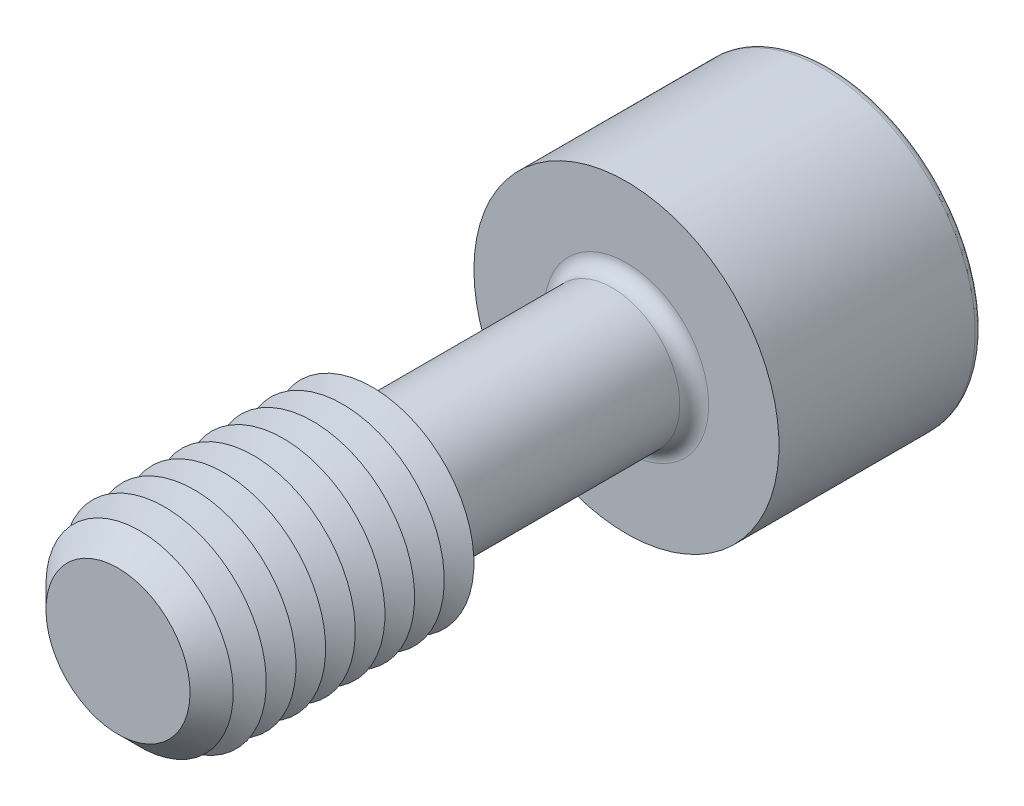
ISO-10303-21;
HEADER;
FILE_DESCRIPTION(('STEP AP214'),'2;1');
FILE_NAME('part.step','',(''),(''),'','','');
FILE_SCHEMA(('AUTOMOTIVE_DESIGN { 1 0 10303 214 1 1 1 1 }'));
ENDSEC;
DATA;
#1=APPLICATION_CONTEXT('core data for automotive mechanical design processes');
#2=APPLICATION_PROTOCOL_DEFINITION('international standard','automotive_design',2000,#1);
#3=PRODUCT_CONTEXT('',#1,'mechanical');
#4=PRODUCT('Part','Part','',(#3));
#5=PRODUCT_RELATED_PRODUCT_CATEGORY('part','',(#4));
#6=PRODUCT_DEFINITION_FORMATION('','',#4);
#7=PRODUCT_DEFINITION_CONTEXT('part definition',#1,'design');
#8=PRODUCT_DEFINITION('design','',#6,#7);
#9=PRODUCT_DEFINITION_SHAPE('','',#8);
#10=(LENGTH_UNIT() NAMED_UNIT(*) SI_UNIT(.MILLI.,.METRE.));
#11=(NAMED_UNIT(*) PLANE_ANGLE_UNIT() SI_UNIT($,.RADIAN.));
#12=(NAMED_UNIT(*) SI_UNIT($,.STERADIAN.) SOLID_ANGLE_UNIT());
#13=UNCERTAINTY_MEASURE_WITH_UNIT(LENGTH_MEASURE(1.E-05),#10,'distance_accuracy_value','');
#14=(GEOMETRIC_REPRESENTATION_CONTEXT(3) GLOBAL_UNCERTAINTY_ASSIGNED_CONTEXT((#13)) GLOBAL_UNIT_ASSIGNED_CONTEXT((#10,
#11,#12)) REPRESENTATION_CONTEXT('',''));
#15=CARTESIAN_POINT('',(0.,0.,0.));
#16=DIRECTION('',(0.,0.,1.));
#17=DIRECTION('',(1.,0.,0.));
#18=AXIS2_PLACEMENT_3D('',#15,#16,#17);
#19=CARTESIAN_POINT('',(-2.88675134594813,-5.,-17.));
#20=DIRECTION('',(0.,0.,1.));
#21=DIRECTION('',(1.,0.,0.));
#22=AXIS2_PLACEMENT_3D('',#19,#20,#21);
#23=PLANE('',#22);
#24=DIRECTION('',(1.,0.,0.));
#25=VECTOR('',#24,1.);
#26=CARTESIAN_POINT('',(-2.88675134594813,-5.,-17.));
#27=LINE('',#26,#25);
#28=CARTESIAN_POINT('',(0.,-5.,-17.));
#29=VERTEX_POINT('',#28);
#30=CARTESIAN_POINT('',(2.88675134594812,-5.,-17.));
#31=VERTEX_POINT('',#30);
#32=EDGE_CURVE('E762',#29,#31,#27,.T.);
#33=ORIENTED_EDGE('',*,*,#32,.F.);
#34=CARTESIAN_POINT('',(0.,0.,-17.));
#35=DIRECTION('',(0.,0.,1.));
#36=DIRECTION('',(0.,-1.,0.));
#37=AXIS2_PLACEMENT_3D('',#34,#35,#36);
#38=CIRCLE('',#37,5.);
#39=CARTESIAN_POINT('',(4.3301270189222,-2.5,-17.));
#40=VERTEX_POINT('',#39);
#41=EDGE_CURVE('E53',#29,#40,#38,.T.);
#42=ORIENTED_EDGE('',*,*,#41,.T.);
#43=DIRECTION('',(0.5,0.866025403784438,0.));
#44=VECTOR('',#43,1.);
#45=CARTESIAN_POINT('',(2.88675134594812,-5.,-17.));
#46=LINE('',#45,#44);
#47=EDGE_CURVE('E748',#31,#40,#46,.T.);
#48=ORIENTED_EDGE('',*,*,#47,.F.);
#49=EDGE_LOOP('',(#33,#42,#48));
#50=FACE_BOUND('',#49,.T.);
#51=ADVANCED_FACE('F41',(#50),#23,.F.);
#52=CARTESIAN_POINT('',(5.77350269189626,0.,-17.));
#53=VERTEX_POINT('',#52);
#54=EDGE_CURVE('E759',#40,#53,#46,.T.);
#55=ORIENTED_EDGE('',*,*,#54,.F.);
#56=CARTESIAN_POINT('',(4.3301270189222,2.50000000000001,-17.));
#57=VERTEX_POINT('',#56);
#58=EDGE_CURVE('E11',#40,#57,#38,.T.);
#59=ORIENTED_EDGE('',*,*,#58,.T.);
#60=DIRECTION('',(-0.5,0.866025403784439,0.));
#61=VECTOR('',#60,1.);
#62=CARTESIAN_POINT('',(5.77350269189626,0.,-17.));
#63=LINE('',#62,#61);
#64=EDGE_CURVE('E747',#53,#57,#63,.T.);
#65=ORIENTED_EDGE('',*,*,#64,.F.);
#66=EDGE_LOOP('',(#55,#59,#65));
#67=FACE_BOUND('',#66,.T.);
#68=ADVANCED_FACE('F133',(#67),#23,.F.);
#69=CARTESIAN_POINT('',(2.88675134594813,5.,-17.));
#70=VERTEX_POINT('',#69);
#71=EDGE_CURVE('E743',#57,#70,#63,.T.);
#72=ORIENTED_EDGE('',*,*,#71,.F.);
#73=CARTESIAN_POINT('',(0.,5.00000000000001,-17.));
#74=VERTEX_POINT('',#73);
#75=EDGE_CURVE('E51',#57,#74,#38,.T.);
#76=ORIENTED_EDGE('',*,*,#75,.T.);
#77=DIRECTION('',(-1.,0.,0.));
#78=VECTOR('',#77,1.);
#79=CARTESIAN_POINT('',(2.88675134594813,5.,-17.));
#80=LINE('',#79,#78);
#81=EDGE_CURVE('E177',#70,#74,#80,.T.);
#82=ORIENTED_EDGE('',*,*,#81,.F.);
#83=EDGE_LOOP('',(#72,#76,#82));
#84=FACE_BOUND('',#83,.T.);
#85=ADVANCED_FACE('F139',(#84),#23,.F.);
#86=CARTESIAN_POINT('',(-2.88675134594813,5.,-17.));
#87=VERTEX_POINT('',#86);
#88=EDGE_CURVE('E753',#74,#87,#80,.T.);
#89=ORIENTED_EDGE('',*,*,#88,.F.);
#90=CARTESIAN_POINT('',(-4.3301270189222,2.50000000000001,-17.));
#91=VERTEX_POINT('',#90);
#92=EDGE_CURVE('E264',#74,#91,#38,.T.);
#93=ORIENTED_EDGE('',*,*,#92,.T.);
#94=DIRECTION('',(-0.5,-0.866025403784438,0.));
#95=VECTOR('',#94,1.);
#96=CARTESIAN_POINT('',(-2.88675134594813,5.,-17.));
#97=LINE('',#96,#95);
#98=EDGE_CURVE('E176',#87,#91,#97,.T.);
#99=ORIENTED_EDGE('',*,*,#98,.F.);
#100=EDGE_LOOP('',(#89,#93,#99));
#101=FACE_BOUND('',#100,.T.);
#102=ADVANCED_FACE('F157',(#101),#23,.F.);
#103=CARTESIAN_POINT('',(-5.77350269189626,0.,-17.));
#104=VERTEX_POINT('',#103);
#105=EDGE_CURVE('E170',#91,#104,#97,.T.);
#106=ORIENTED_EDGE('',*,*,#105,.F.);
#107=CARTESIAN_POINT('',(-4.3301270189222,-2.5,-17.));
#108=VERTEX_POINT('',#107);
#109=EDGE_CURVE('E172',#91,#108,#38,.T.);
#110=ORIENTED_EDGE('',*,*,#109,.T.);
#111=DIRECTION('',(0.5,-0.866025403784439,0.));
#112=VECTOR('',#111,1.);
#113=CARTESIAN_POINT('',(-5.77350269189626,0.,-17.));
#114=LINE('',#113,#112);
#115=EDGE_CURVE('E174',#104,#108,#114,.T.);
#116=ORIENTED_EDGE('',*,*,#115,.F.);
#117=EDGE_LOOP('',(#106,#110,#116));
#118=FACE_BOUND('',#117,.T.);
#119=ADVANCED_FACE('F146',(#118),#23,.F.);
#120=CARTESIAN_POINT('',(0.,0.,-27.));
#121=DIRECTION('',(0.,0.,-1.));
#122=DIRECTION('',(-1.,0.,0.));
#123=AXIS2_PLACEMENT_3D('',#120,#121,#122);
#124=PLANE('',#123);
#125=CARTESIAN_POINT('',(0.,0.,-27.));
#126=DIRECTION('',(0.,0.,-1.));
#127=DIRECTION('',(-1.,0.,0.));
#128=AXIS2_PLACEMENT_3D('',#125,#126,#127);
#129=CIRCLE('',#128,8.575);
#130=CARTESIAN_POINT('',(-8.575,0.,-27.));
#131=VERTEX_POINT('',#130);
#132=EDGE_CURVE('E250',#131,#131,#129,.T.);
#133=ORIENTED_EDGE('',*,*,#132,.T.);
#134=EDGE_LOOP('',(#133));
#135=FACE_BOUND('',#134,.T.);
#136=DIRECTION('',(-0.5,-0.866025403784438,0.));
#137=VECTOR('',#136,1.);
#138=CARTESIAN_POINT('',(-2.88675134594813,5.,-27.));
#139=LINE('',#138,#137);
#140=CARTESIAN_POINT('',(-2.88675134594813,5.,-27.));
#141=VERTEX_POINT('',#140);
#142=CARTESIAN_POINT('',(-5.77350269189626,0.,-27.));
#143=VERTEX_POINT('',#142);
#144=EDGE_CURVE('E211',#141,#143,#139,.T.);
#145=ORIENTED_EDGE('',*,*,#144,.T.);
#146=DIRECTION('',(0.5,-0.866025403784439,0.));
#147=VECTOR('',#146,1.);
#148=CARTESIAN_POINT('',(-5.77350269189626,0.,-27.));
#149=LINE('',#148,#147);
#150=CARTESIAN_POINT('',(-2.88675134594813,-5.,-27.));
#151=VERTEX_POINT('',#150);
#152=EDGE_CURVE('E67',#143,#151,#149,.T.);
#153=ORIENTED_EDGE('',*,*,#152,.T.);
#154=DIRECTION('',(1.,0.,0.));
#155=VECTOR('',#154,1.);
#156=CARTESIAN_POINT('',(-2.88675134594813,-5.,-27.));
#157=LINE('',#156,#155);
#158=CARTESIAN_POINT('',(2.88675134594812,-5.,-27.));
#159=VERTEX_POINT('',#158);
#160=EDGE_CURVE('E196',#151,#159,#157,.T.);
#161=ORIENTED_EDGE('',*,*,#160,.T.);
#162=DIRECTION('',(0.5,0.866025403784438,0.));
#163=VECTOR('',#162,1.);
#164=CARTESIAN_POINT('',(2.88675134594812,-5.,-27.));
#165=LINE('',#164,#163);
#166=CARTESIAN_POINT('',(5.77350269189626,0.,-27.));
#167=VERTEX_POINT('',#166);
#168=EDGE_CURVE('E199',#159,#167,#165,.T.);
#169=ORIENTED_EDGE('',*,*,#168,.T.);
#170=DIRECTION('',(-0.5,0.866025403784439,0.));
#171=VECTOR('',#170,1.);
#172=CARTESIAN_POINT('',(5.77350269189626,0.,-27.));
#173=LINE('',#172,#171);
#174=CARTESIAN_POINT('',(2.88675134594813,5.,-27.));
#175=VERTEX_POINT('',#174);
#176=EDGE_CURVE('E203',#167,#175,#173,.T.);
#177=ORIENTED_EDGE('',*,*,#176,.T.);
#178=DIRECTION('',(-1.,0.,0.));
#179=VECTOR('',#178,1.);
#180=CARTESIAN_POINT('',(2.88675134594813,5.,-27.));
#181=LINE('',#180,#179);
#182=EDGE_CURVE('E207',#175,#141,#181,.T.);
#183=ORIENTED_EDGE('',*,*,#182,.T.);
#184=EDGE_LOOP('',(#145,#153,#161,#169,#177,#183));
#185=FACE_BOUND('',#184,.T.);
#186=ADVANCED_FACE('F156',(#135,#185),#124,.T.);
#187=CARTESIAN_POINT('',(0.,0.,15.));
#188=DIRECTION('',(0.,0.,-1.));
#189=DIRECTION('',(-1.,0.,0.));
#190=AXIS2_PLACEMENT_3D('',#187,#188,#189);
#191=CYLINDRICAL_SURFACE('',#190,4.);
#192=CARTESIAN_POINT('',(0.,0.,-14.15));
#193=DIRECTION('',(0.,0.,-1.));
#194=DIRECTION('',(-1.,0.,0.));
#195=AXIS2_PLACEMENT_3D('',#192,#193,#194);
#196=CIRCLE('',#195,4.);
#197=CARTESIAN_POINT('',(-4.,0.,-14.15));
#198=VERTEX_POINT('',#197);
#199=EDGE_CURVE('E246',#198,#198,#196,.F.);
#200=ORIENTED_EDGE('',*,*,#199,.T.);
#201=EDGE_LOOP('',(#200));
#202=FACE_BOUND('',#201,.T.);
#203=CARTESIAN_POINT('',(0.,0.,-1.15470053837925));
#204=DIRECTION('',(0.,0.,-1.));
#205=DIRECTION('',(0.,1.,0.));
#206=AXIS2_PLACEMENT_3D('',#203,#204,#205);
#207=CIRCLE('',#206,4.);
#208=CARTESIAN_POINT('',(0.,4.,-1.15470053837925));
#209=VERTEX_POINT('',#208);
#210=EDGE_CURVE('E234',#209,#209,#207,.T.);
#211=ORIENTED_EDGE('',*,*,#210,.T.);
#212=EDGE_LOOP('',(#211));
#213=FACE_BOUND('',#212,.T.);
#214=ADVANCED_FACE('F163',(#202,#213),#191,.T.);
#215=CARTESIAN_POINT('',(0.,0.,-1.15470053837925));
#216=DIRECTION('',(0.,0.,1.));
#217=DIRECTION('',(0.,-1.,0.));
#218=AXIS2_PLACEMENT_3D('',#215,#216,#217);
#219=CONICAL_SURFACE('',#218,4.,1.0471975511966);
#220=CARTESIAN_POINT('',(0.,0.,0.));
#221=DIRECTION('',(0.,0.,-1.));
#222=DIRECTION('',(-1.,0.,0.));
#223=AXIS2_PLACEMENT_3D('',#220,#221,#222);
#224=CIRCLE('',#223,6.);
#225=CARTESIAN_POINT('',(-6.,0.,0.));
#226=VERTEX_POINT('',#225);
#227=EDGE_CURVE('E268',#226,#226,#224,.T.);
#228=ORIENTED_EDGE('',*,*,#227,.T.);
#229=EDGE_LOOP('',(#228));
#230=FACE_BOUND('',#229,.T.);
#231=ORIENTED_EDGE('',*,*,#210,.F.);
#232=EDGE_LOOP('',(#231));
#233=FACE_BOUND('',#232,.T.);
#234=ADVANCED_FACE('F512',(#230,#233),#219,.T.);
#235=CARTESIAN_POINT('',(0.,0.,-15.));
#236=DIRECTION('',(0.,0.,-1.));
#237=DIRECTION('',(-1.,0.,0.));
#238=AXIS2_PLACEMENT_3D('',#235,#236,#237);
#239=PLANE('',#238);
#240=CARTESIAN_POINT('',(0.,0.,-15.));
#241=DIRECTION('',(0.,0.,-1.));
#242=DIRECTION('',(-1.,0.,0.));
#243=AXIS2_PLACEMENT_3D('',#240,#241,#242);
#244=CIRCLE('',#243,4.85);
#245=CARTESIAN_POINT('',(-4.85,0.,-15.));
#246=VERTEX_POINT('',#245);
#247=EDGE_CURVE('E242',#246,#246,#244,.T.);
#248=ORIENTED_EDGE('',*,*,#247,.T.);
#249=EDGE_LOOP('',(#248));
#250=FACE_BOUND('',#249,.T.);
#251=CARTESIAN_POINT('',(0.,0.,-15.));
#252=DIRECTION('',(0.,0.,-1.));
#253=DIRECTION('',(-1.,0.,0.));
#254=AXIS2_PLACEMENT_3D('',#251,#252,#253);
#255=CIRCLE('',#254,9.);
#256=CARTESIAN_POINT('',(-9.,0.,-15.));
#257=VERTEX_POINT('',#256);
#258=EDGE_CURVE('E230',#257,#257,#255,.T.);
#259=ORIENTED_EDGE('',*,*,#258,.F.);
#260=EDGE_LOOP('',(#259));
#261=FACE_BOUND('',#260,.T.);
#262=ADVANCED_FACE('F505',(#250,#261),#239,.F.);
#263=CARTESIAN_POINT('',(0.,0.,-27.));
#264=DIRECTION('',(0.,0.,1.));
#265=DIRECTION('',(1.,0.,0.));
#266=AXIS2_PLACEMENT_3D('',#263,#264,#265);
#267=CYLINDRICAL_SURFACE('',#266,9.);
#268=CARTESIAN_POINT('',(0.,0.,-26.575));
#269=DIRECTION('',(0.,0.,-1.));
#270=DIRECTION('',(-1.,0.,0.));
#271=AXIS2_PLACEMENT_3D('',#268,#269,#270);
#272=CIRCLE('',#271,9.);
#273=CARTESIAN_POINT('',(-9.,0.,-26.575));
#274=VERTEX_POINT('',#273);
#275=EDGE_CURVE('E253',#274,#274,#272,.F.);
#276=ORIENTED_EDGE('',*,*,#275,.T.);
#277=EDGE_LOOP('',(#276));
#278=FACE_BOUND('',#277,.T.);
#279=ORIENTED_EDGE('',*,*,#258,.T.);
#280=EDGE_LOOP('',(#279));
#281=FACE_BOUND('',#280,.T.);
#282=ADVANCED_FACE('F511',(#278,#281),#267,.T.);
#283=CARTESIAN_POINT('',(-5.77350269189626,0.,-17.));
#284=DIRECTION('',(0.866025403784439,0.5,0.));
#285=DIRECTION('',(-0.5,0.866025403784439,0.));
#286=AXIS2_PLACEMENT_3D('',#283,#284,#285);
#287=PLANE('',#286);
#288=ORIENTED_EDGE('',*,*,#152,.F.);
#289=DIRECTION('',(0.,0.,-1.));
#290=VECTOR('',#289,1.);
#291=CARTESIAN_POINT('',(-5.77350269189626,0.,-17.));
#292=LINE('',#291,#290);
#293=EDGE_CURVE('E186',#104,#143,#292,.T.);
#294=ORIENTED_EDGE('',*,*,#293,.F.);
#295=ORIENTED_EDGE('',*,*,#115,.T.);
#296=CARTESIAN_POINT('',(-2.88675134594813,-5.,-17.));
#297=VERTEX_POINT('',#296);
#298=EDGE_CURVE('E214',#108,#297,#114,.T.);
#299=ORIENTED_EDGE('',*,*,#298,.T.);
#300=DIRECTION('',(0.,0.,-1.));
#301=VECTOR('',#300,1.);
#302=CARTESIAN_POINT('',(-2.88675134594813,-5.,-17.));
#303=LINE('',#302,#301);
#304=EDGE_CURVE('E227',#297,#151,#303,.T.);
#305=ORIENTED_EDGE('',*,*,#304,.T.);
#306=EDGE_LOOP('',(#288,#294,#295,#299,#305));
#307=FACE_BOUND('',#306,.T.);
#308=ADVANCED_FACE('F523',(#307),#287,.T.);
#309=CARTESIAN_POINT('',(-2.88675134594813,-5.,-17.));
#310=DIRECTION('',(0.,1.,0.));
#311=DIRECTION('',(0.,0.,1.));
#312=AXIS2_PLACEMENT_3D('',#309,#310,#311);
#313=PLANE('',#312);
#314=ORIENTED_EDGE('',*,*,#160,.F.);
#315=ORIENTED_EDGE('',*,*,#304,.F.);
#316=EDGE_CURVE('E760',#297,#29,#27,.T.);
#317=ORIENTED_EDGE('',*,*,#316,.T.);
#318=ORIENTED_EDGE('',*,*,#32,.T.);
#319=DIRECTION('',(0.,0.,-1.));
#320=VECTOR('',#319,1.);
#321=CARTESIAN_POINT('',(2.88675134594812,-5.,-17.));
#322=LINE('',#321,#320);
#323=EDGE_CURVE('E224',#31,#159,#322,.T.);
#324=ORIENTED_EDGE('',*,*,#323,.T.);
#325=EDGE_LOOP('',(#314,#315,#317,#318,#324));
#326=FACE_BOUND('',#325,.T.);
#327=ADVANCED_FACE('F539',(#326),#313,.T.);
#328=CARTESIAN_POINT('',(2.88675134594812,-5.,-17.));
#329=DIRECTION('',(-0.866025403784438,0.5,0.));
#330=DIRECTION('',(-0.5,-0.866025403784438,0.));
#331=AXIS2_PLACEMENT_3D('',#328,#329,#330);
#332=PLANE('',#331);
#333=ORIENTED_EDGE('',*,*,#168,.F.);
#334=ORIENTED_EDGE('',*,*,#323,.F.);
#335=ORIENTED_EDGE('',*,*,#47,.T.);
#336=ORIENTED_EDGE('',*,*,#54,.T.);
#337=DIRECTION('',(0.,0.,-1.));
#338=VECTOR('',#337,1.);
#339=CARTESIAN_POINT('',(5.77350269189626,0.,-17.));
#340=LINE('',#339,#338);
#341=EDGE_CURVE('E221',#53,#167,#340,.T.);
#342=ORIENTED_EDGE('',*,*,#341,.T.);
#343=EDGE_LOOP('',(#333,#334,#335,#336,#342));
#344=FACE_BOUND('',#343,.T.);
#345=ADVANCED_FACE('F549',(#344),#332,.T.);
#346=CARTESIAN_POINT('',(5.77350269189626,0.,-17.));
#347=DIRECTION('',(-0.866025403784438,-0.5,0.));
#348=DIRECTION('',(0.5,-0.866025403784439,0.));
#349=AXIS2_PLACEMENT_3D('',#346,#347,#348);
#350=PLANE('',#349);
#351=ORIENTED_EDGE('',*,*,#176,.F.);
#352=ORIENTED_EDGE('',*,*,#341,.F.);
#353=ORIENTED_EDGE('',*,*,#64,.T.);
#354=ORIENTED_EDGE('',*,*,#71,.T.);
#355=DIRECTION('',(0.,0.,-1.));
#356=VECTOR('',#355,1.);
#357=CARTESIAN_POINT('',(2.88675134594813,5.,-17.));
#358=LINE('',#357,#356);
#359=EDGE_CURVE('E218',#70,#175,#358,.T.);
#360=ORIENTED_EDGE('',*,*,#359,.T.);
#361=EDGE_LOOP('',(#351,#352,#353,#354,#360));
#362=FACE_BOUND('',#361,.T.);
#363=ADVANCED_FACE('F559',(#362),#350,.T.);
#364=CARTESIAN_POINT('',(2.88675134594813,5.,-17.));
#365=DIRECTION('',(0.,-1.,0.));
#366=DIRECTION('',(0.,0.,-1.));
#367=AXIS2_PLACEMENT_3D('',#364,#365,#366);
#368=PLANE('',#367);
#369=ORIENTED_EDGE('',*,*,#182,.F.);
#370=ORIENTED_EDGE('',*,*,#359,.F.);
#371=ORIENTED_EDGE('',*,*,#81,.T.);
#372=ORIENTED_EDGE('',*,*,#88,.T.);
#373=DIRECTION('',(0.,0.,-1.));
#374=VECTOR('',#373,1.);
#375=CARTESIAN_POINT('',(-2.88675134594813,5.,-17.));
#376=LINE('',#375,#374);
#377=EDGE_CURVE('E182',#87,#141,#376,.T.);
#378=ORIENTED_EDGE('',*,*,#377,.T.);
#379=EDGE_LOOP('',(#369,#370,#371,#372,#378));
#380=FACE_BOUND('',#379,.T.);
#381=ADVANCED_FACE('F152',(#380),#368,.T.);
#382=CARTESIAN_POINT('',(-2.88675134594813,5.,-17.));
#383=DIRECTION('',(0.866025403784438,-0.5,0.));
#384=DIRECTION('',(0.5,0.866025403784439,0.));
#385=AXIS2_PLACEMENT_3D('',#382,#383,#384);
#386=PLANE('',#385);
#387=ORIENTED_EDGE('',*,*,#144,.F.);
#388=ORIENTED_EDGE('',*,*,#377,.F.);
#389=ORIENTED_EDGE('',*,*,#98,.T.);
#390=ORIENTED_EDGE('',*,*,#105,.T.);
#391=ORIENTED_EDGE('',*,*,#293,.T.);
#392=EDGE_LOOP('',(#387,#388,#389,#390,#391));
#393=FACE_BOUND('',#392,.T.);
#394=ADVANCED_FACE('F144',(#393),#386,.T.);
#395=ORIENTED_EDGE('',*,*,#298,.F.);
#396=EDGE_CURVE('E256',#108,#29,#38,.T.);
#397=ORIENTED_EDGE('',*,*,#396,.T.);
#398=ORIENTED_EDGE('',*,*,#316,.F.);
#399=EDGE_LOOP('',(#395,#397,#398));
#400=FACE_BOUND('',#399,.T.);
#401=ADVANCED_FACE('F135',(#400),#23,.F.);
#402=CARTESIAN_POINT('',(0.,0.,-14.15));
#403=DIRECTION('',(0.,0.,-1.));
#404=DIRECTION('',(-1.,0.,0.));
#405=AXIS2_PLACEMENT_3D('',#402,#403,#404);
#406=TOROIDAL_SURFACE('',#405,4.85,0.85);
#407=ORIENTED_EDGE('',*,*,#199,.F.);
#408=EDGE_LOOP('',(#407));
#409=FACE_BOUND('',#408,.T.);
#410=ORIENTED_EDGE('',*,*,#247,.F.);
#411=EDGE_LOOP('',(#410));
#412=FACE_BOUND('',#411,.T.);
#413=ADVANCED_FACE('F129',(#409,#412),#406,.F.);
#414=CARTESIAN_POINT('',(0.,0.,-26.575));
#415=DIRECTION('',(0.,0.,-1.));
#416=DIRECTION('',(-1.,0.,0.));
#417=AXIS2_PLACEMENT_3D('',#414,#415,#416);
#418=TOROIDAL_SURFACE('',#417,8.575,0.425);
#419=ORIENTED_EDGE('',*,*,#275,.F.);
#420=EDGE_LOOP('',(#419));
#421=FACE_BOUND('',#420,.T.);
#422=ORIENTED_EDGE('',*,*,#132,.F.);
#423=EDGE_LOOP('',(#422));
#424=FACE_BOUND('',#423,.T.);
#425=ADVANCED_FACE('F43',(#421,#424),#418,.T.);
#426=CARTESIAN_POINT('',(0.,0.,-14.1132486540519));
#427=DIRECTION('',(0.,0.,-1.));
#428=DIRECTION('',(0.,1.,0.));
#429=AXIS2_PLACEMENT_3D('',#426,#427,#428);
#430=CONICAL_SURFACE('',#429,0.,1.04719755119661);
#431=ORIENTED_EDGE('',*,*,#41,.F.);
#432=ORIENTED_EDGE('',*,*,#396,.F.);
#433=ORIENTED_EDGE('',*,*,#109,.F.);
#434=ORIENTED_EDGE('',*,*,#92,.F.);
#435=ORIENTED_EDGE('',*,*,#75,.F.);
#436=ORIENTED_EDGE('',*,*,#58,.F.);
#437=EDGE_LOOP('',(#431,#432,#433,#434,#435,#436));
#438=FACE_BOUND('',#437,.T.);
#439=CARTESIAN_POINT('',(0.,0.,-14.1132486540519));
#440=VERTEX_POINT('',#439);
#441=VERTEX_LOOP('',#440);
#442=FACE_BOUND('',#441,.T.);
#443=ADVANCED_FACE('F118',(#438,#442),#430,.F.);
#444=CARTESIAN_POINT('',(0.,0.,0.875000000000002));
#445=DIRECTION('',(0.,0.,-1.));
#446=DIRECTION('',(-1.,0.,0.));
#447=AXIS2_PLACEMENT_3D('',#444,#445,#446);
#448=CONICAL_SURFACE('',#447,4.48445554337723,1.0471975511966);
#449=ORIENTED_EDGE('',*,*,#227,.F.);
#450=EDGE_LOOP('',(#449));
#451=FACE_BOUND('',#450,.T.);
#452=CARTESIAN_POINT('',(0.,0.,0.875000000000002));
#453=DIRECTION('',(0.,0.,-1.));
#454=DIRECTION('',(-1.,0.,0.));
#455=AXIS2_PLACEMENT_3D('',#452,#453,#454);
#456=CIRCLE('',#455,4.48445554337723);
#457=CARTESIAN_POINT('',(-4.48445554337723,0.,0.875000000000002));
#458=VERTEX_POINT('',#457);
#459=EDGE_CURVE('E274',#458,#458,#456,.T.);
#460=ORIENTED_EDGE('',*,*,#459,.T.);
#461=EDGE_LOOP('',(#460));
#462=FACE_BOUND('',#461,.T.);
#463=ADVANCED_FACE('F120',(#451,#462),#448,.T.);
#464=CARTESIAN_POINT('',(0.,0.,1.75));
#465=DIRECTION('',(0.,0.,1.));
#466=DIRECTION('',(1.,0.,0.));
#467=AXIS2_PLACEMENT_3D('',#464,#465,#466);
#468=CONICAL_SURFACE('',#467,6.,1.0471975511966);
#469=ORIENTED_EDGE('',*,*,#459,.F.);
#470=EDGE_LOOP('',(#469));
#471=FACE_BOUND('',#470,.T.);
#472=CARTESIAN_POINT('',(0.,0.,1.75));
#473=DIRECTION('',(0.,0.,-1.));
#474=DIRECTION('',(-1.,0.,0.));
#475=AXIS2_PLACEMENT_3D('',#472,#473,#474);
#476=CIRCLE('',#475,6.);
#477=CARTESIAN_POINT('',(-6.,0.,1.75));
#478=VERTEX_POINT('',#477);
#479=EDGE_CURVE('E280',#478,#478,#476,.T.);
#480=ORIENTED_EDGE('',*,*,#479,.T.);
#481=EDGE_LOOP('',(#480));
#482=FACE_BOUND('',#481,.T.);
#483=ADVANCED_FACE('F126',(#471,#482),#468,.T.);
#484=CARTESIAN_POINT('',(0.,0.,2.625));
#485=DIRECTION('',(0.,0.,-1.));
#486=DIRECTION('',(-1.,0.,0.));
#487=AXIS2_PLACEMENT_3D('',#484,#485,#486);
#488=CONICAL_SURFACE('',#487,4.48445554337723,1.0471975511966);
#489=ORIENTED_EDGE('',*,*,#479,.F.);
#490=EDGE_LOOP('',(#489));
#491=FACE_BOUND('',#490,.T.);
#492=CARTESIAN_POINT('',(0.,0.,2.625));
#493=DIRECTION('',(0.,0.,-1.));
#494=DIRECTION('',(-1.,0.,0.));
#495=AXIS2_PLACEMENT_3D('',#492,#493,#494);
#496=CIRCLE('',#495,4.48445554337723);
#497=CARTESIAN_POINT('',(-4.48445554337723,0.,2.625));
#498=VERTEX_POINT('',#497);
#499=EDGE_CURVE('E286',#498,#498,#496,.T.);
#500=ORIENTED_EDGE('',*,*,#499,.T.);
#501=EDGE_LOOP('',(#500));
#502=FACE_BOUND('',#501,.T.);
#503=ADVANCED_FACE('F399',(#491,#502),#488,.T.);
#504=CARTESIAN_POINT('',(0.,0.,3.5));
#505=DIRECTION('',(0.,0.,1.));
#506=DIRECTION('',(1.,0.,0.));
#507=AXIS2_PLACEMENT_3D('',#504,#505,#506);
#508=CONICAL_SURFACE('',#507,6.,1.0471975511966);
#509=ORIENTED_EDGE('',*,*,#499,.F.);
#510=EDGE_LOOP('',(#509));
#511=FACE_BOUND('',#510,.T.);
#512=CARTESIAN_POINT('',(0.,0.,3.5));
#513=DIRECTION('',(0.,0.,-1.));
#514=DIRECTION('',(-1.,0.,0.));
#515=AXIS2_PLACEMENT_3D('',#512,#513,#514);
#516=CIRCLE('',#515,6.);
#517=CARTESIAN_POINT('',(-6.,0.,3.5));
#518=VERTEX_POINT('',#517);
#519=EDGE_CURVE('E290',#518,#518,#516,.T.);
#520=ORIENTED_EDGE('',*,*,#519,.T.);
#521=EDGE_LOOP('',(#520));
#522=FACE_BOUND('',#521,.T.);
#523=ADVANCED_FACE('F395',(#511,#522),#508,.T.);
#524=CARTESIAN_POINT('',(0.,0.,4.375));
#525=DIRECTION('',(0.,0.,-1.));
#526=DIRECTION('',(-1.,0.,0.));
#527=AXIS2_PLACEMENT_3D('',#524,#525,#526);
#528=CONICAL_SURFACE('',#527,4.48445554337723,1.0471975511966);
#529=ORIENTED_EDGE('',*,*,#519,.F.);
#530=EDGE_LOOP('',(#529));
#531=FACE_BOUND('',#530,.T.);
#532=CARTESIAN_POINT('',(0.,0.,4.375));
#533=DIRECTION('',(0.,0.,-1.));
#534=DIRECTION('',(-1.,0.,0.));
#535=AXIS2_PLACEMENT_3D('',#532,#533,#534);
#536=CIRCLE('',#535,4.48445554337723);
#537=CARTESIAN_POINT('',(-4.48445554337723,0.,4.375));
#538=VERTEX_POINT('',#537);
#539=EDGE_CURVE('E294',#538,#538,#536,.T.);
#540=ORIENTED_EDGE('',*,*,#539,.T.);
#541=EDGE_LOOP('',(#540));
#542=FACE_BOUND('',#541,.T.);
#543=ADVANCED_FACE('F391',(#531,#542),#528,.T.);
#544=CARTESIAN_POINT('',(0.,0.,5.25));
#545=DIRECTION('',(0.,0.,1.));
#546=DIRECTION('',(1.,0.,0.));
#547=AXIS2_PLACEMENT_3D('',#544,#545,#546);
#548=CONICAL_SURFACE('',#547,6.,1.0471975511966);
#549=ORIENTED_EDGE('',*,*,#539,.F.);
#550=EDGE_LOOP('',(#549));
#551=FACE_BOUND('',#550,.T.);
#552=CARTESIAN_POINT('',(0.,0.,5.25));
#553=DIRECTION('',(0.,0.,-1.));
#554=DIRECTION('',(-1.,0.,0.));
#555=AXIS2_PLACEMENT_3D('',#552,#553,#554);
#556=CIRCLE('',#555,6.);
#557=CARTESIAN_POINT('',(-6.,0.,5.25));
#558=VERTEX_POINT('',#557);
#559=EDGE_CURVE('E297',#558,#558,#556,.T.);
#560=ORIENTED_EDGE('',*,*,#559,.T.);
#561=EDGE_LOOP('',(#560));
#562=FACE_BOUND('',#561,.T.);
#563=ADVANCED_FACE('F387',(#551,#562),#548,.T.);
#564=CARTESIAN_POINT('',(0.,0.,6.125));
#565=DIRECTION('',(0.,0.,-1.));
#566=DIRECTION('',(-1.,0.,0.));
#567=AXIS2_PLACEMENT_3D('',#564,#565,#566);
#568=CONICAL_SURFACE('',#567,4.48445554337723,1.0471975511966);
#569=ORIENTED_EDGE('',*,*,#559,.F.);
#570=EDGE_LOOP('',(#569));
#571=FACE_BOUND('',#570,.T.);
#572=CARTESIAN_POINT('',(0.,0.,6.125));
#573=DIRECTION('',(0.,0.,-1.));
#574=DIRECTION('',(-1.,0.,0.));
#575=AXIS2_PLACEMENT_3D('',#572,#573,#574);
#576=CIRCLE('',#575,4.48445554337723);
#577=CARTESIAN_POINT('',(-4.48445554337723,0.,6.125));
#578=VERTEX_POINT('',#577);
#579=EDGE_CURVE('E301',#578,#578,#576,.T.);
#580=ORIENTED_EDGE('',*,*,#579,.T.);
#581=EDGE_LOOP('',(#580));
#582=FACE_BOUND('',#581,.T.);
#583=ADVANCED_FACE('F383',(#571,#582),#568,.T.);
#584=CARTESIAN_POINT('',(0.,0.,7.));
#585=DIRECTION('',(0.,0.,1.));
#586=DIRECTION('',(1.,0.,0.));
#587=AXIS2_PLACEMENT_3D('',#584,#585,#586);
#588=CONICAL_SURFACE('',#587,6.,1.0471975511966);
#589=ORIENTED_EDGE('',*,*,#579,.F.);
#590=EDGE_LOOP('',(#589));
#591=FACE_BOUND('',#590,.T.);
#592=CARTESIAN_POINT('',(0.,0.,7.));
#593=DIRECTION('',(0.,0.,-1.));
#594=DIRECTION('',(-1.,0.,0.));
#595=AXIS2_PLACEMENT_3D('',#592,#593,#594);
#596=CIRCLE('',#595,6.);
#597=CARTESIAN_POINT('',(-6.,0.,7.));
#598=VERTEX_POINT('',#597);
#599=EDGE_CURVE('E305',#598,#598,#596,.T.);
#600=ORIENTED_EDGE('',*,*,#599,.T.);
#601=EDGE_LOOP('',(#600));
#602=FACE_BOUND('',#601,.T.);
#603=ADVANCED_FACE('F379',(#591,#602),#588,.T.);
#604=CARTESIAN_POINT('',(0.,0.,7.875));
#605=DIRECTION('',(0.,0.,-1.));
#606=DIRECTION('',(-1.,0.,0.));
#607=AXIS2_PLACEMENT_3D('',#604,#605,#606);
#608=CONICAL_SURFACE('',#607,4.48445554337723,1.0471975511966);
#609=ORIENTED_EDGE('',*,*,#599,.F.);
#610=EDGE_LOOP('',(#609));
#611=FACE_BOUND('',#610,.T.);
#612=CARTESIAN_POINT('',(0.,0.,7.875));
#613=DIRECTION('',(0.,0.,-1.));
#614=DIRECTION('',(-1.,0.,0.));
#615=AXIS2_PLACEMENT_3D('',#612,#613,#614);
#616=CIRCLE('',#615,4.48445554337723);
#617=CARTESIAN_POINT('',(-4.48445554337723,0.,7.875));
#618=VERTEX_POINT('',#617);
#619=EDGE_CURVE('E309',#618,#618,#616,.T.);
#620=ORIENTED_EDGE('',*,*,#619,.T.);
#621=EDGE_LOOP('',(#620));
#622=FACE_BOUND('',#621,.T.);
#623=ADVANCED_FACE('F375',(#611,#622),#608,.T.);
#624=CARTESIAN_POINT('',(0.,0.,8.75));
#625=DIRECTION('',(0.,0.,1.));
#626=DIRECTION('',(1.,0.,0.));
#627=AXIS2_PLACEMENT_3D('',#624,#625,#626);
#628=CONICAL_SURFACE('',#627,6.,1.0471975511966);
#629=ORIENTED_EDGE('',*,*,#619,.F.);
#630=EDGE_LOOP('',(#629));
#631=FACE_BOUND('',#630,.T.);
#632=CARTESIAN_POINT('',(0.,0.,8.75));
#633=DIRECTION('',(0.,0.,-1.));
#634=DIRECTION('',(-1.,0.,0.));
#635=AXIS2_PLACEMENT_3D('',#632,#633,#634);
#636=CIRCLE('',#635,6.);
#637=CARTESIAN_POINT('',(-6.,0.,8.75));
#638=VERTEX_POINT('',#637);
#639=EDGE_CURVE('E313',#638,#638,#636,.T.);
#640=ORIENTED_EDGE('',*,*,#639,.T.);
#641=EDGE_LOOP('',(#640));
#642=FACE_BOUND('',#641,.T.);
#643=ADVANCED_FACE('F371',(#631,#642),#628,.T.);
#644=CARTESIAN_POINT('',(0.,0.,9.625));
#645=DIRECTION('',(0.,0.,-1.));
#646=DIRECTION('',(-1.,0.,0.));
#647=AXIS2_PLACEMENT_3D('',#644,#645,#646);
#648=CONICAL_SURFACE('',#647,4.48445554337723,1.0471975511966);
#649=ORIENTED_EDGE('',*,*,#639,.F.);
#650=EDGE_LOOP('',(#649));
#651=FACE_BOUND('',#650,.T.);
#652=CARTESIAN_POINT('',(0.,0.,9.625));
#653=DIRECTION('',(0.,0.,-1.));
#654=DIRECTION('',(-1.,0.,0.));
#655=AXIS2_PLACEMENT_3D('',#652,#653,#654);
#656=CIRCLE('',#655,4.48445554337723);
#657=CARTESIAN_POINT('',(-4.48445554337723,0.,9.625));
#658=VERTEX_POINT('',#657);
#659=EDGE_CURVE('E317',#658,#658,#656,.T.);
#660=ORIENTED_EDGE('',*,*,#659,.T.);
#661=EDGE_LOOP('',(#660));
#662=FACE_BOUND('',#661,.T.);
#663=ADVANCED_FACE('F367',(#651,#662),#648,.T.);
#664=CARTESIAN_POINT('',(0.,0.,10.5));
#665=DIRECTION('',(0.,0.,1.));
#666=DIRECTION('',(1.,0.,0.));
#667=AXIS2_PLACEMENT_3D('',#664,#665,#666);
#668=CONICAL_SURFACE('',#667,6.,1.0471975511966);
#669=ORIENTED_EDGE('',*,*,#659,.F.);
#670=EDGE_LOOP('',(#669));
#671=FACE_BOUND('',#670,.T.);
#672=CARTESIAN_POINT('',(0.,0.,10.5));
#673=DIRECTION('',(0.,0.,-1.));
#674=DIRECTION('',(-1.,0.,0.));
#675=AXIS2_PLACEMENT_3D('',#672,#673,#674);
#676=CIRCLE('',#675,6.);
#677=CARTESIAN_POINT('',(-6.,0.,10.5));
#678=VERTEX_POINT('',#677);
#679=EDGE_CURVE('E321',#678,#678,#676,.T.);
#680=ORIENTED_EDGE('',*,*,#679,.T.);
#681=EDGE_LOOP('',(#680));
#682=FACE_BOUND('',#681,.T.);
#683=ADVANCED_FACE('F363',(#671,#682),#668,.T.);
#684=CARTESIAN_POINT('',(0.,0.,11.375));
#685=DIRECTION('',(0.,0.,-1.));
#686=DIRECTION('',(-1.,0.,0.));
#687=AXIS2_PLACEMENT_3D('',#684,#685,#686);
#688=CONICAL_SURFACE('',#687,4.48445554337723,1.0471975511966);
#689=ORIENTED_EDGE('',*,*,#679,.F.);
#690=EDGE_LOOP('',(#689));
#691=FACE_BOUND('',#690,.T.);
#692=CARTESIAN_POINT('',(0.,0.,11.375));
#693=DIRECTION('',(0.,0.,-1.));
#694=DIRECTION('',(-1.,0.,0.));
#695=AXIS2_PLACEMENT_3D('',#692,#693,#694);
#696=CIRCLE('',#695,4.48445554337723);
#697=CARTESIAN_POINT('',(-4.48445554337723,0.,11.375));
#698=VERTEX_POINT('',#697);
#699=EDGE_CURVE('E325',#698,#698,#696,.T.);
#700=ORIENTED_EDGE('',*,*,#699,.T.);
#701=EDGE_LOOP('',(#700));
#702=FACE_BOUND('',#701,.T.);
#703=ADVANCED_FACE('F359',(#691,#702),#688,.T.);
#704=CARTESIAN_POINT('',(0.,0.,12.25));
#705=DIRECTION('',(0.,0.,1.));
#706=DIRECTION('',(1.,0.,0.));
#707=AXIS2_PLACEMENT_3D('',#704,#705,#706);
#708=CONICAL_SURFACE('',#707,6.,1.0471975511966);
#709=ORIENTED_EDGE('',*,*,#699,.F.);
#710=EDGE_LOOP('',(#709));
#711=FACE_BOUND('',#710,.T.);
#712=CARTESIAN_POINT('',(0.,0.,12.25));
#713=DIRECTION('',(0.,0.,-1.));
#714=DIRECTION('',(-1.,0.,0.));
#715=AXIS2_PLACEMENT_3D('',#712,#713,#714);
#716=CIRCLE('',#715,6.);
#717=CARTESIAN_POINT('',(-6.,0.,12.25));
#718=VERTEX_POINT('',#717);
#719=EDGE_CURVE('E328',#718,#718,#716,.T.);
#720=ORIENTED_EDGE('',*,*,#719,.T.);
#721=EDGE_LOOP('',(#720));
#722=FACE_BOUND('',#721,.T.);
#723=ADVANCED_FACE('F352',(#711,#722),#708,.T.);
#724=CARTESIAN_POINT('',(0.,0.,13.125));
#725=DIRECTION('',(0.,0.,-1.));
#726=DIRECTION('',(-1.,0.,0.));
#727=AXIS2_PLACEMENT_3D('',#724,#725,#726);
#728=CONICAL_SURFACE('',#727,4.48445554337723,1.0471975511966);
#729=ORIENTED_EDGE('',*,*,#719,.F.);
#730=EDGE_LOOP('',(#729));
#731=FACE_BOUND('',#730,.T.);
#732=CARTESIAN_POINT('',(0.,0.,13.125));
#733=DIRECTION('',(0.,0.,-1.));
#734=DIRECTION('',(-1.,0.,0.));
#735=AXIS2_PLACEMENT_3D('',#732,#733,#734);
#736=CIRCLE('',#735,4.48445554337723);
#737=CARTESIAN_POINT('',(-4.48445554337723,0.,13.125));
#738=VERTEX_POINT('',#737);
#739=EDGE_CURVE('E332',#738,#738,#736,.T.);
#740=ORIENTED_EDGE('',*,*,#739,.T.);
#741=EDGE_LOOP('',(#740));
#742=FACE_BOUND('',#741,.T.);
#743=ADVANCED_FACE('F338',(#731,#742),#728,.T.);
#744=CARTESIAN_POINT('',(0.,0.,14.));
#745=DIRECTION('',(0.,0.,1.));
#746=DIRECTION('',(1.,0.,0.));
#747=AXIS2_PLACEMENT_3D('',#744,#745,#746);
#748=CONICAL_SURFACE('',#747,6.,1.0471975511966);
#749=CARTESIAN_POINT('',(0.,0.,13.7254809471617));
#750=DIRECTION('',(0.,0.,1.));
#751=DIRECTION('',(1.,0.,0.));
#752=AXIS2_PLACEMENT_3D('',#749,#750,#751);
#753=CIRCLE('',#752,5.52451905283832);
#754=CARTESIAN_POINT('',(0.,5.52451905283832,13.7254809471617));
#755=VERTEX_POINT('',#754);
#756=EDGE_CURVE('E45',#755,#755,#753,.F.);
#757=ORIENTED_EDGE('',*,*,#756,.T.);
#758=EDGE_LOOP('',(#757));
#759=FACE_BOUND('',#758,.T.);
#760=ORIENTED_EDGE('',*,*,#739,.F.);
#761=EDGE_LOOP('',(#760));
#762=FACE_BOUND('',#761,.T.);
#763=ADVANCED_FACE('F340',(#759,#762),#748,.T.);
#764=CARTESIAN_POINT('',(0.,0.,15.));
#765=DIRECTION('',(0.,0.,1.));
#766=DIRECTION('',(1.,0.,0.));
#767=AXIS2_PLACEMENT_3D('',#764,#765,#766);
#768=PLANE('',#767);
#769=CARTESIAN_POINT('',(0.,0.,15.));
#770=DIRECTION('',(0.,0.,1.));
#771=DIRECTION('',(1.,0.,0.));
#772=AXIS2_PLACEMENT_3D('',#769,#770,#771);
#773=CIRCLE('',#772,4.24999999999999);
#774=CARTESIAN_POINT('',(0.,4.24999999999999,15.));
#775=VERTEX_POINT('',#774);
#776=EDGE_CURVE('E238',#775,#775,#773,.T.);
#777=ORIENTED_EDGE('',*,*,#776,.T.);
#778=EDGE_LOOP('',(#777));
#779=FACE_BOUND('',#778,.T.);
#780=ADVANCED_FACE('F342',(#779),#768,.T.);
#781=CARTESIAN_POINT('',(0.,0.,13.25));
#782=DIRECTION('',(0.,0.,-1.));
#783=DIRECTION('',(0.,1.,0.));
#784=AXIS2_PLACEMENT_3D('',#781,#782,#783);
#785=CONICAL_SURFACE('',#784,6.,0.78539816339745);
#786=CARTESIAN_POINT('',(0.,5.52451905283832,13.7254809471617));
#787=CARTESIAN_POINT('',(0.,5.51124281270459,13.7387571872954));
#788=CARTESIAN_POINT('',(0.,5.49796657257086,13.7520334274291));
#789=CARTESIAN_POINT('',(0.,5.47141409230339,13.7785859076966));
#790=CARTESIAN_POINT('',(0.,5.45813785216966,13.7918621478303));
#791=CARTESIAN_POINT('',(0.,5.43158537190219,13.8184146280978));
#792=CARTESIAN_POINT('',(0.,5.41830913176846,13.8316908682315));
#793=CARTESIAN_POINT('',(0.,5.391756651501,13.858243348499));
#794=CARTESIAN_POINT('',(0.,5.37848041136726,13.8715195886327));
#795=CARTESIAN_POINT('',(0.,5.3519279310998,13.8980720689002));
#796=CARTESIAN_POINT('',(0.,5.33865169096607,13.9113483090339));
#797=CARTESIAN_POINT('',(0.,5.3120992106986,13.9379007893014));
#798=CARTESIAN_POINT('',(0.,5.29882297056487,13.9511770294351));
#799=CARTESIAN_POINT('',(0.,5.2722704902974,13.9777295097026));
#800=CARTESIAN_POINT('',(0.,5.25899425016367,13.9910057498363));
#801=CARTESIAN_POINT('',(0.,5.2324417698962,14.0175582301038));
#802=CARTESIAN_POINT('',(0.,5.21916552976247,14.0308344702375));
#803=CARTESIAN_POINT('',(0.,5.19261304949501,14.057386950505));
#804=CARTESIAN_POINT('',(0.,5.17933680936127,14.0706631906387));
#805=CARTESIAN_POINT('',(0.,5.15278432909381,14.0972156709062));
#806=CARTESIAN_POINT('',(0.,5.13950808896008,14.1104919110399));
#807=CARTESIAN_POINT('',(0.,5.11295560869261,14.1370443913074));
#808=CARTESIAN_POINT('',(0.,5.09967936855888,14.1503206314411));
#809=CARTESIAN_POINT('',(0.,5.07312688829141,14.1768731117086));
#810=CARTESIAN_POINT('',(0.,5.05985064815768,14.1901493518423));
#811=CARTESIAN_POINT('',(0.,5.03329816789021,14.2167018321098));
#812=CARTESIAN_POINT('',(0.,5.02002192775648,14.2299780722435));
#813=CARTESIAN_POINT('',(0.,4.99346944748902,14.256530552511));
#814=CARTESIAN_POINT('',(0.,4.98019320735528,14.2698067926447));
#815=CARTESIAN_POINT('',(0.,4.95364072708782,14.2963592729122));
#816=CARTESIAN_POINT('',(0.,4.94036448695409,14.3096355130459));
#817=CARTESIAN_POINT('',(0.,4.91381200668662,14.3361879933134));
#818=CARTESIAN_POINT('',(0.,4.90053576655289,14.3494642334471));
#819=CARTESIAN_POINT('',(0.,4.87398328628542,14.3760167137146));
#820=CARTESIAN_POINT('',(0.,4.86070704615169,14.3892929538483));
#821=CARTESIAN_POINT('',(0.,4.83415456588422,14.4158454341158));
#822=CARTESIAN_POINT('',(0.,4.82087832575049,14.4291216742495));
#823=CARTESIAN_POINT('',(0.,4.79432584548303,14.455674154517));
#824=CARTESIAN_POINT('',(0.,4.78104960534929,14.4689503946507));
#825=CARTESIAN_POINT('',(0.,4.75449712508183,14.4955028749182));
#826=CARTESIAN_POINT('',(0.,4.7412208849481,14.5087791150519));
#827=CARTESIAN_POINT('',(0.,4.71466840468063,14.5353315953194));
#828=CARTESIAN_POINT('',(0.,4.7013921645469,14.5486078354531));
#829=CARTESIAN_POINT('',(0.,4.67483968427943,14.5751603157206));
#830=CARTESIAN_POINT('',(0.,4.6615634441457,14.5884365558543));
#831=CARTESIAN_POINT('',(0.,4.63501096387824,14.6149890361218));
#832=CARTESIAN_POINT('',(0.,4.6217347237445,14.6282652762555));
#833=CARTESIAN_POINT('',(0.,4.59518224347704,14.654817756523));
#834=CARTESIAN_POINT('',(0.,4.5819060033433,14.6680939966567));
#835=CARTESIAN_POINT('',(0.,4.55535352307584,14.6946464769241));
#836=CARTESIAN_POINT('',(0.,4.54207728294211,14.7079227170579));
#837=CARTESIAN_POINT('',(0.,4.51552480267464,14.7344751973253));
#838=CARTESIAN_POINT('',(0.,4.50224856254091,14.7477514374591));
#839=CARTESIAN_POINT('',(0.,4.47569608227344,14.7743039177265));
#840=CARTESIAN_POINT('',(0.,4.46241984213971,14.7875801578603));
#841=CARTESIAN_POINT('',(0.,4.43586736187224,14.8141326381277));
#842=CARTESIAN_POINT('',(0.,4.42259112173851,14.8274088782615));
#843=CARTESIAN_POINT('',(0.,4.39603864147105,14.8539613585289));
#844=CARTESIAN_POINT('',(0.,4.38276240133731,14.8672375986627));
#845=CARTESIAN_POINT('',(0.,4.35620992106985,14.8937900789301));
#846=CARTESIAN_POINT('',(0.,4.34293368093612,14.9070663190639));
#847=CARTESIAN_POINT('',(0.,4.31638120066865,14.9336187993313));
#848=CARTESIAN_POINT('',(0.,4.30310496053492,14.9468950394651));
#849=CARTESIAN_POINT('',(0.,4.27655248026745,14.9734475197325));
#850=CARTESIAN_POINT('',(0.,4.26327624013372,14.9867237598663));
#851=CARTESIAN_POINT('',(0.,4.24999999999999,15.));
#852=B_SPLINE_CURVE_WITH_KNOTS('',3,(#786,#787,#788,#789,#790,#791,#792,#793,#794,#795,#796,
#797,#798,#799,#800,#801,#802,#803,#804,#805,#806,#807,#808,#809,#810,#811,#812,#813,#814,#815,
#816,#817,#818,#819,#820,#821,#822,#823,#824,#825,#826,#827,#828,#829,#830,#831,#832,#833,#834,
#835,#836,#837,#838,#839,#840,#841,#842,#843,#844,#845,#846,#847,#848,#849,#850,#851),
.UNSPECIFIED.,.F.,.F.,(4,2,2,2,2,2,2,2,2,2,2,2,2,2,2,2,2,2,2,2,2,2,2,2,2,2,2,2,2,2,2,2,4),(0.,
0.0563263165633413,0.112652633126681,0.168978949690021,0.225305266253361,0.2816315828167,
0.337957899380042,0.394284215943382,0.450610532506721,0.506936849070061,0.563263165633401,
0.619589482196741,0.675915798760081,0.732242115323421,0.788568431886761,0.844894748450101,
0.901221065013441,0.957547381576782,1.01387369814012,1.07020001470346,1.1265263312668,
1.18285264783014,1.23917896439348,1.29550528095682,1.35183159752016,1.4081579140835,
1.46448423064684,1.52081054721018,1.57713686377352,1.63346318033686,1.6897894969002,
1.74611581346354,1.80244213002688),.UNSPECIFIED.);
#853=EDGE_CURVE('BSEAM349',#755,#775,#852,.T.);
#854=ORIENTED_EDGE('',*,*,#756,.F.);
#855=ORIENTED_EDGE('',*,*,#776,.F.);
#856=ORIENTED_EDGE('',*,*,#853,.T.);
#857=ORIENTED_EDGE('',*,*,#853,.F.);
#858=EDGE_LOOP('',(#854,#856,#855,#857));
#859=FACE_BOUND('',#858,.T.);
#860=ADVANCED_FACE('F349',(#859),#785,.T.);
#861=CLOSED_SHELL('',(#51,#68,#85,#102,#119,#186,#214,#234,#262,#282,#308,#327,#345,#363,#381,
#394,#401,#413,#425,#443,#463,#483,#503,#523,#543,#563,#583,#603,#623,#643,#663,#683,#703,#723,
#743,#763,#780,#860));
#862=MANIFOLD_SOLID_BREP('B2',#861);
#863=ADVANCED_BREP_SHAPE_REPRESENTATION('',(#18,#862),#14);
#864=SHAPE_DEFINITION_REPRESENTATION(#9,#863);
ENDSEC;
END-ISO-10303-21;
